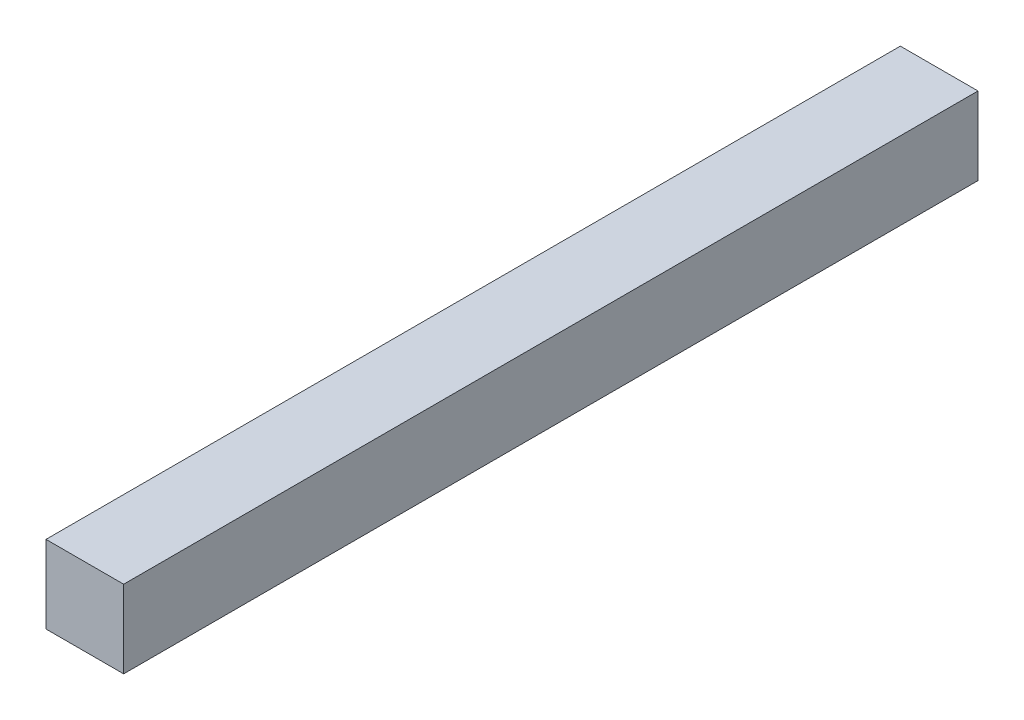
ISO-10303-21;
HEADER;
FILE_DESCRIPTION(('STEP AP214'),'2;1');
FILE_NAME('part.step','',(''),(''),'','','');
FILE_SCHEMA(('AUTOMOTIVE_DESIGN { 1 0 10303 214 1 1 1 1 }'));
ENDSEC;
DATA;
#1=APPLICATION_CONTEXT('core data for automotive mechanical design processes');
#2=APPLICATION_PROTOCOL_DEFINITION('international standard','automotive_design',2000,#1);
#3=PRODUCT_CONTEXT('',#1,'mechanical');
#4=PRODUCT('Part','Part','',(#3));
#5=PRODUCT_RELATED_PRODUCT_CATEGORY('part','',(#4));
#6=PRODUCT_DEFINITION_FORMATION('','',#4);
#7=PRODUCT_DEFINITION_CONTEXT('part definition',#1,'design');
#8=PRODUCT_DEFINITION('design','',#6,#7);
#9=PRODUCT_DEFINITION_SHAPE('','',#8);
#10=(LENGTH_UNIT() NAMED_UNIT(*) SI_UNIT(.MILLI.,.METRE.));
#11=(NAMED_UNIT(*) PLANE_ANGLE_UNIT() SI_UNIT($,.RADIAN.));
#12=(NAMED_UNIT(*) SI_UNIT($,.STERADIAN.) SOLID_ANGLE_UNIT());
#13=UNCERTAINTY_MEASURE_WITH_UNIT(LENGTH_MEASURE(1.E-05),#10,'distance_accuracy_value','');
#14=(GEOMETRIC_REPRESENTATION_CONTEXT(3) GLOBAL_UNCERTAINTY_ASSIGNED_CONTEXT((#13)) GLOBAL_UNIT_ASSIGNED_CONTEXT((#10,
#11,#12)) REPRESENTATION_CONTEXT('',''));
#15=CARTESIAN_POINT('',(0.,0.,0.));
#16=DIRECTION('',(0.,0.,1.));
#17=DIRECTION('',(1.,0.,0.));
#18=AXIS2_PLACEMENT_3D('',#15,#16,#17);
#19=CARTESIAN_POINT('',(2.5,-2.5,55.));
#20=DIRECTION('',(-1.,0.,0.));
#21=DIRECTION('',(0.,0.,1.));
#22=AXIS2_PLACEMENT_3D('',#19,#20,#21);
#23=PLANE('',#22);
#24=DIRECTION('',(0.,1.,0.));
#25=VECTOR('',#24,1.);
#26=CARTESIAN_POINT('',(2.5,-2.5,0.));
#27=LINE('',#26,#25);
#28=CARTESIAN_POINT('',(2.5,-2.5,0.));
#29=VERTEX_POINT('',#28);
#30=CARTESIAN_POINT('',(2.5,2.5,0.));
#31=VERTEX_POINT('',#30);
#32=EDGE_CURVE('E96',#29,#31,#27,.T.);
#33=ORIENTED_EDGE('',*,*,#32,.T.);
#34=DIRECTION('',(0.,0.,-1.));
#35=VECTOR('',#34,1.);
#36=CARTESIAN_POINT('',(2.5,2.5,55.));
#37=LINE('',#36,#35);
#38=CARTESIAN_POINT('',(2.5,2.5,55.));
#39=VERTEX_POINT('',#38);
#40=EDGE_CURVE('E11',#39,#31,#37,.T.);
#41=ORIENTED_EDGE('',*,*,#40,.F.);
#42=DIRECTION('',(0.,1.,0.));
#43=VECTOR('',#42,1.);
#44=CARTESIAN_POINT('',(2.5,-2.5,55.));
#45=LINE('',#44,#43);
#46=CARTESIAN_POINT('',(2.5,-2.5,55.));
#47=VERTEX_POINT('',#46);
#48=EDGE_CURVE('E84',#47,#39,#45,.T.);
#49=ORIENTED_EDGE('',*,*,#48,.F.);
#50=DIRECTION('',(0.,0.,-1.));
#51=VECTOR('',#50,1.);
#52=CARTESIAN_POINT('',(2.5,-2.5,55.));
#53=LINE('',#52,#51);
#54=EDGE_CURVE('E92',#47,#29,#53,.T.);
#55=ORIENTED_EDGE('',*,*,#54,.T.);
#56=EDGE_LOOP('',(#33,#41,#49,#55));
#57=FACE_BOUND('',#56,.T.);
#58=ADVANCED_FACE('F33',(#57),#23,.F.);
#59=CARTESIAN_POINT('',(-2.5,2.5,55.));
#60=DIRECTION('',(0.,-1.,0.));
#61=DIRECTION('',(0.,0.,-1.));
#62=AXIS2_PLACEMENT_3D('',#59,#60,#61);
#63=PLANE('',#62);
#64=DIRECTION('',(-1.,0.,0.));
#65=VECTOR('',#64,1.);
#66=CARTESIAN_POINT('',(-2.5,2.5,0.));
#67=LINE('',#66,#65);
#68=CARTESIAN_POINT('',(-2.5,2.5,0.));
#69=VERTEX_POINT('',#68);
#70=EDGE_CURVE('E88',#31,#69,#67,.T.);
#71=ORIENTED_EDGE('',*,*,#70,.T.);
#72=DIRECTION('',(0.,0.,-1.));
#73=VECTOR('',#72,1.);
#74=CARTESIAN_POINT('',(-2.5,2.5,55.));
#75=LINE('',#74,#73);
#76=CARTESIAN_POINT('',(-2.5,2.5,55.));
#77=VERTEX_POINT('',#76);
#78=EDGE_CURVE('E41',#77,#69,#75,.T.);
#79=ORIENTED_EDGE('',*,*,#78,.F.);
#80=DIRECTION('',(-1.,0.,0.));
#81=VECTOR('',#80,1.);
#82=CARTESIAN_POINT('',(-2.5,2.5,55.));
#83=LINE('',#82,#81);
#84=EDGE_CURVE('E79',#39,#77,#83,.T.);
#85=ORIENTED_EDGE('',*,*,#84,.F.);
#86=ORIENTED_EDGE('',*,*,#40,.T.);
#87=EDGE_LOOP('',(#71,#79,#85,#86));
#88=FACE_BOUND('',#87,.T.);
#89=ADVANCED_FACE('F87',(#88),#63,.F.);
#90=CARTESIAN_POINT('',(-2.5,-2.5,55.));
#91=DIRECTION('',(1.,0.,0.));
#92=DIRECTION('',(0.,0.,-1.));
#93=AXIS2_PLACEMENT_3D('',#90,#91,#92);
#94=PLANE('',#93);
#95=DIRECTION('',(0.,-1.,0.));
#96=VECTOR('',#95,1.);
#97=CARTESIAN_POINT('',(-2.5,-2.5,0.));
#98=LINE('',#97,#96);
#99=CARTESIAN_POINT('',(-2.5,-2.5,0.));
#100=VERTEX_POINT('',#99);
#101=EDGE_CURVE('E66',#69,#100,#98,.T.);
#102=ORIENTED_EDGE('',*,*,#101,.T.);
#103=DIRECTION('',(0.,0.,-1.));
#104=VECTOR('',#103,1.);
#105=CARTESIAN_POINT('',(-2.5,-2.5,55.));
#106=LINE('',#105,#104);
#107=CARTESIAN_POINT('',(-2.5,-2.5,55.));
#108=VERTEX_POINT('',#107);
#109=EDGE_CURVE('E89',#108,#100,#106,.T.);
#110=ORIENTED_EDGE('',*,*,#109,.F.);
#111=DIRECTION('',(0.,-1.,0.));
#112=VECTOR('',#111,1.);
#113=CARTESIAN_POINT('',(-2.5,-2.5,55.));
#114=LINE('',#113,#112);
#115=EDGE_CURVE('E82',#77,#108,#114,.T.);
#116=ORIENTED_EDGE('',*,*,#115,.F.);
#117=ORIENTED_EDGE('',*,*,#78,.T.);
#118=EDGE_LOOP('',(#102,#110,#116,#117));
#119=FACE_BOUND('',#118,.T.);
#120=ADVANCED_FACE('F90',(#119),#94,.F.);
#121=CARTESIAN_POINT('',(-2.5,-2.5,55.));
#122=DIRECTION('',(0.,1.,0.));
#123=DIRECTION('',(0.,0.,1.));
#124=AXIS2_PLACEMENT_3D('',#121,#122,#123);
#125=PLANE('',#124);
#126=DIRECTION('',(1.,0.,0.));
#127=VECTOR('',#126,1.);
#128=CARTESIAN_POINT('',(-2.5,-2.5,0.));
#129=LINE('',#128,#127);
#130=EDGE_CURVE('E72',#100,#29,#129,.T.);
#131=ORIENTED_EDGE('',*,*,#130,.T.);
#132=ORIENTED_EDGE('',*,*,#54,.F.);
#133=DIRECTION('',(1.,0.,0.));
#134=VECTOR('',#133,1.);
#135=CARTESIAN_POINT('',(-2.5,-2.5,55.));
#136=LINE('',#135,#134);
#137=EDGE_CURVE('E49',#108,#47,#136,.T.);
#138=ORIENTED_EDGE('',*,*,#137,.F.);
#139=ORIENTED_EDGE('',*,*,#109,.T.);
#140=EDGE_LOOP('',(#131,#132,#138,#139));
#141=FACE_BOUND('',#140,.T.);
#142=ADVANCED_FACE('F103',(#141),#125,.F.);
#143=CARTESIAN_POINT('',(0.,0.,55.));
#144=DIRECTION('',(0.,0.,-1.));
#145=DIRECTION('',(-1.,0.,0.));
#146=AXIS2_PLACEMENT_3D('',#143,#144,#145);
#147=PLANE('',#146);
#148=ORIENTED_EDGE('',*,*,#48,.T.);
#149=ORIENTED_EDGE('',*,*,#84,.T.);
#150=ORIENTED_EDGE('',*,*,#115,.T.);
#151=ORIENTED_EDGE('',*,*,#137,.T.);
#152=EDGE_LOOP('',(#148,#149,#150,#151));
#153=FACE_BOUND('',#152,.T.);
#154=ADVANCED_FACE('F80',(#153),#147,.F.);
#155=CARTESIAN_POINT('',(0.,0.,0.));
#156=DIRECTION('',(0.,0.,-1.));
#157=DIRECTION('',(-1.,0.,0.));
#158=AXIS2_PLACEMENT_3D('',#155,#156,#157);
#159=PLANE('',#158);
#160=ORIENTED_EDGE('',*,*,#32,.F.);
#161=ORIENTED_EDGE('',*,*,#130,.F.);
#162=ORIENTED_EDGE('',*,*,#101,.F.);
#163=ORIENTED_EDGE('',*,*,#70,.F.);
#164=EDGE_LOOP('',(#160,#161,#162,#163));
#165=FACE_BOUND('',#164,.T.);
#166=ADVANCED_FACE('F106',(#165),#159,.T.);
#167=CLOSED_SHELL('',(#58,#89,#120,#142,#154,#166));
#168=MANIFOLD_SOLID_BREP('B2',#167);
#169=ADVANCED_BREP_SHAPE_REPRESENTATION('',(#18,#168),#14);
#170=SHAPE_DEFINITION_REPRESENTATION(#9,#169);
ENDSEC;
END-ISO-10303-21;
